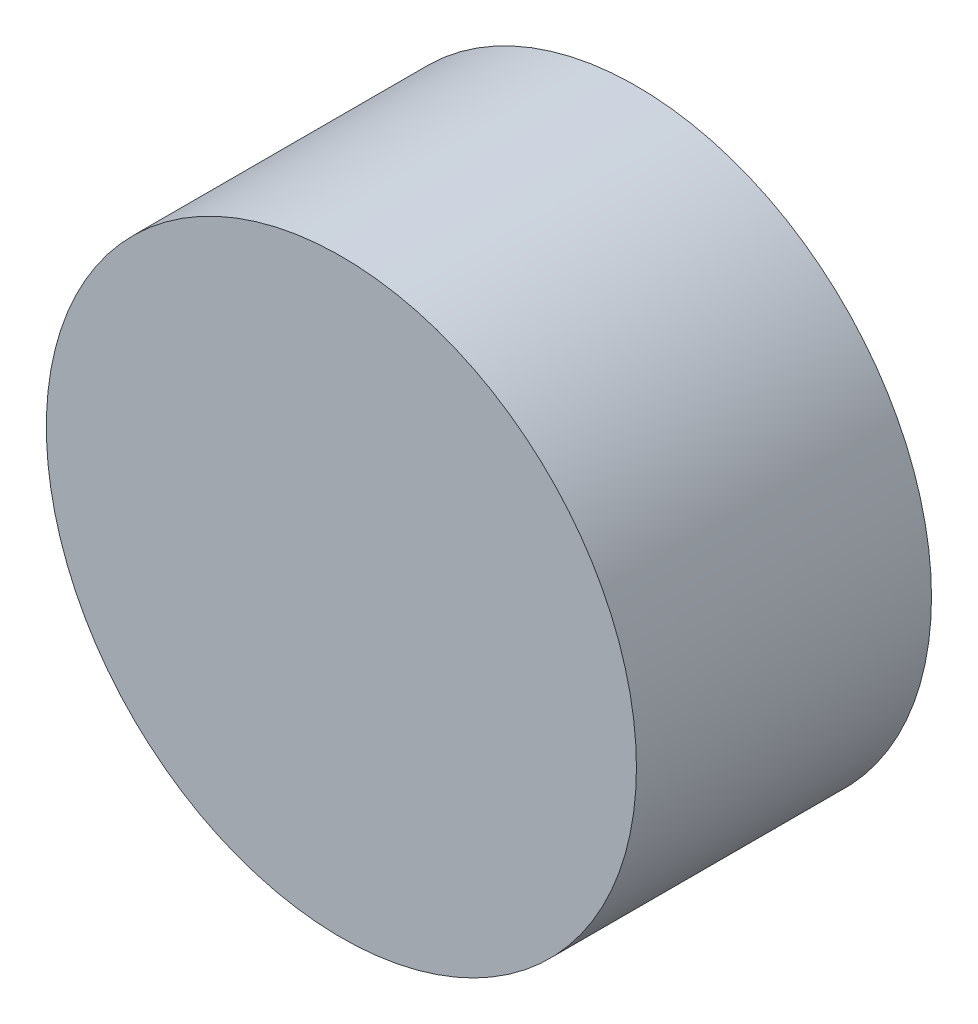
ISO-10303-21;
HEADER;
FILE_DESCRIPTION(('STEP AP214'),'2;1');
FILE_NAME('part.step','',(''),(''),'','','');
FILE_SCHEMA(('AUTOMOTIVE_DESIGN { 1 0 10303 214 1 1 1 1 }'));
ENDSEC;
DATA;
#1=APPLICATION_CONTEXT('core data for automotive mechanical design processes');
#2=APPLICATION_PROTOCOL_DEFINITION('international standard','automotive_design',2000,#1);
#3=PRODUCT_CONTEXT('',#1,'mechanical');
#4=PRODUCT('Part','Part','',(#3));
#5=PRODUCT_RELATED_PRODUCT_CATEGORY('part','',(#4));
#6=PRODUCT_DEFINITION_FORMATION('','',#4);
#7=PRODUCT_DEFINITION_CONTEXT('part definition',#1,'design');
#8=PRODUCT_DEFINITION('design','',#6,#7);
#9=PRODUCT_DEFINITION_SHAPE('','',#8);
#10=(LENGTH_UNIT() NAMED_UNIT(*) SI_UNIT(.MILLI.,.METRE.));
#11=(NAMED_UNIT(*) PLANE_ANGLE_UNIT() SI_UNIT($,.RADIAN.));
#12=(NAMED_UNIT(*) SI_UNIT($,.STERADIAN.) SOLID_ANGLE_UNIT());
#13=UNCERTAINTY_MEASURE_WITH_UNIT(LENGTH_MEASURE(1.E-05),#10,'distance_accuracy_value','');
#14=(GEOMETRIC_REPRESENTATION_CONTEXT(3) GLOBAL_UNCERTAINTY_ASSIGNED_CONTEXT((#13)) GLOBAL_UNIT_ASSIGNED_CONTEXT((#10,
#11,#12)) REPRESENTATION_CONTEXT('',''));
#15=CARTESIAN_POINT('',(0.,0.,0.));
#16=DIRECTION('',(0.,0.,1.));
#17=DIRECTION('',(1.,0.,0.));
#18=AXIS2_PLACEMENT_3D('',#15,#16,#17);
#19=CARTESIAN_POINT('',(0.,0.,0.));
#20=DIRECTION('',(0.,0.,-1.));
#21=DIRECTION('',(-1.,0.,0.));
#22=AXIS2_PLACEMENT_3D('',#19,#20,#21);
#23=CYLINDRICAL_SURFACE('',#22,0.5);
#24=CARTESIAN_POINT('',(0.,0.,0.));
#25=DIRECTION('',(0.,0.,1.));
#26=DIRECTION('',(1.,0.,0.));
#27=AXIS2_PLACEMENT_3D('',#24,#25,#26);
#28=CIRCLE('',#27,0.5);
#29=CARTESIAN_POINT('',(0.5,0.,0.));
#30=VERTEX_POINT('',#29);
#31=EDGE_CURVE('E10',#30,#30,#28,.T.);
#32=ORIENTED_EDGE('',*,*,#31,.F.);
#33=EDGE_LOOP('',(#32));
#34=FACE_BOUND('',#33,.T.);
#35=CARTESIAN_POINT('',(0.,0.,-0.5));
#36=DIRECTION('',(0.,0.,1.));
#37=DIRECTION('',(1.,0.,0.));
#38=AXIS2_PLACEMENT_3D('',#35,#36,#37);
#39=CIRCLE('',#38,0.5);
#40=CARTESIAN_POINT('',(0.5,0.,-0.5));
#41=VERTEX_POINT('',#40);
#42=EDGE_CURVE('E33',#41,#41,#39,.T.);
#43=ORIENTED_EDGE('',*,*,#42,.T.);
#44=EDGE_LOOP('',(#43));
#45=FACE_BOUND('',#44,.T.);
#46=ADVANCED_FACE('F30',(#34,#45),#23,.T.);
#47=CARTESIAN_POINT('',(0.,0.,0.));
#48=DIRECTION('',(0.,0.,1.));
#49=DIRECTION('',(1.,0.,0.));
#50=AXIS2_PLACEMENT_3D('',#47,#48,#49);
#51=PLANE('',#50);
#52=ORIENTED_EDGE('',*,*,#31,.T.);
#53=EDGE_LOOP('',(#52));
#54=FACE_BOUND('',#53,.T.);
#55=ADVANCED_FACE('F45',(#54),#51,.T.);
#56=CARTESIAN_POINT('',(0.,0.,-0.5));
#57=DIRECTION('',(0.,0.,1.));
#58=DIRECTION('',(1.,0.,0.));
#59=AXIS2_PLACEMENT_3D('',#56,#57,#58);
#60=PLANE('',#59);
#61=ORIENTED_EDGE('',*,*,#42,.F.);
#62=EDGE_LOOP('',(#61));
#63=FACE_BOUND('',#62,.T.);
#64=ADVANCED_FACE('F43',(#63),#60,.F.);
#65=CLOSED_SHELL('',(#46,#55,#64));
#66=MANIFOLD_SOLID_BREP('B2',#65);
#67=ADVANCED_BREP_SHAPE_REPRESENTATION('',(#18,#66),#14);
#68=SHAPE_DEFINITION_REPRESENTATION(#9,#67);
ENDSEC;
END-ISO-10303-21;
